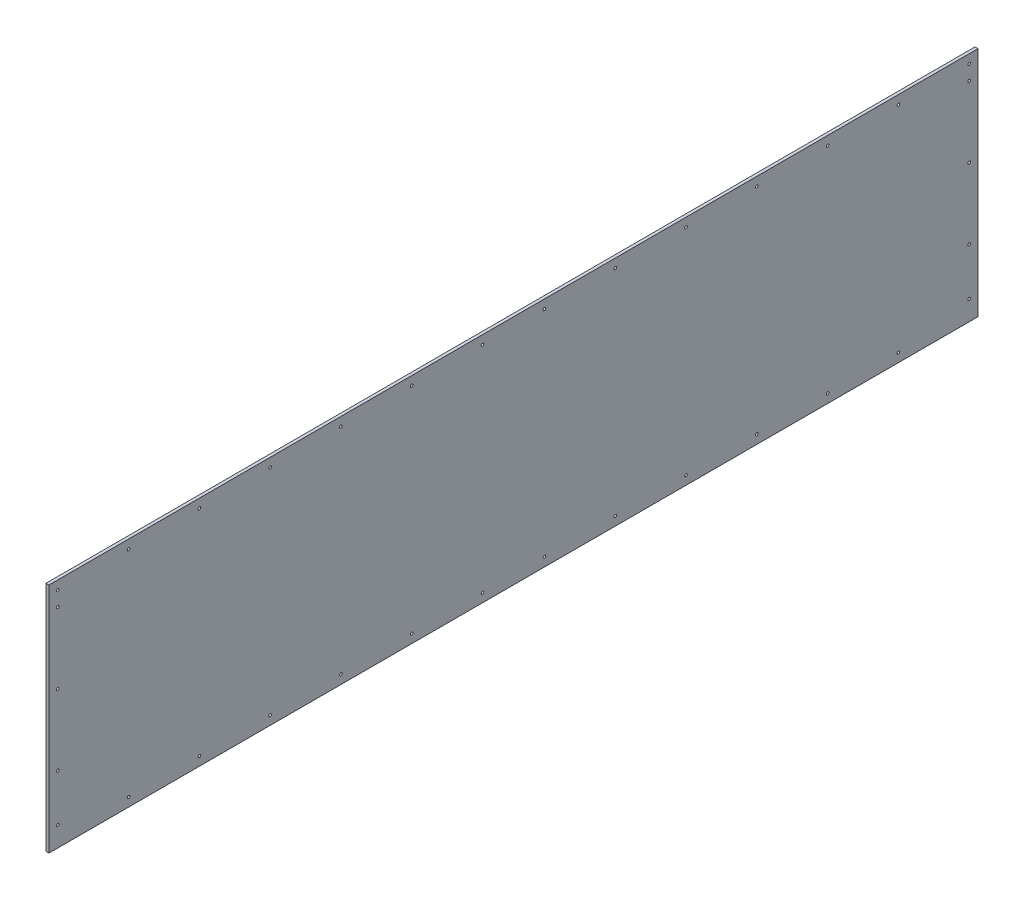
ISO-10303-21;
HEADER;
FILE_DESCRIPTION(('STEP AP214'),'2;1');
FILE_NAME('part.step','',(''),(''),'','','');
FILE_SCHEMA(('AUTOMOTIVE_DESIGN { 1 0 10303 214 1 1 1 1 }'));
ENDSEC;
DATA;
#1=APPLICATION_CONTEXT('core data for automotive mechanical design processes');
#2=APPLICATION_PROTOCOL_DEFINITION('international standard','automotive_design',2000,#1);
#3=PRODUCT_CONTEXT('',#1,'mechanical');
#4=PRODUCT('Part','Part','',(#3));
#5=PRODUCT_RELATED_PRODUCT_CATEGORY('part','',(#4));
#6=PRODUCT_DEFINITION_FORMATION('','',#4);
#7=PRODUCT_DEFINITION_CONTEXT('part definition',#1,'design');
#8=PRODUCT_DEFINITION('design','',#6,#7);
#9=PRODUCT_DEFINITION_SHAPE('','',#8);
#10=(LENGTH_UNIT() NAMED_UNIT(*) SI_UNIT(.MILLI.,.METRE.));
#11=(NAMED_UNIT(*) PLANE_ANGLE_UNIT() SI_UNIT($,.RADIAN.));
#12=(NAMED_UNIT(*) SI_UNIT($,.STERADIAN.) SOLID_ANGLE_UNIT());
#13=UNCERTAINTY_MEASURE_WITH_UNIT(LENGTH_MEASURE(1.E-05),#10,'distance_accuracy_value','');
#14=(GEOMETRIC_REPRESENTATION_CONTEXT(3) GLOBAL_UNCERTAINTY_ASSIGNED_CONTEXT((#13)) GLOBAL_UNIT_ASSIGNED_CONTEXT((#10,
#11,#12)) REPRESENTATION_CONTEXT('',''));
#15=CARTESIAN_POINT('',(0.,0.,0.));
#16=DIRECTION('',(0.,0.,1.));
#17=DIRECTION('',(1.,0.,0.));
#18=AXIS2_PLACEMENT_3D('',#15,#16,#17);
#19=CARTESIAN_POINT('',(6.35,0.,0.));
#20=DIRECTION('',(0.,0.,-1.));
#21=DIRECTION('',(-1.,0.,0.));
#22=AXIS2_PLACEMENT_3D('',#19,#20,#21);
#23=PLANE('',#22);
#24=DIRECTION('',(0.,-1.,0.));
#25=VECTOR('',#24,1.);
#26=CARTESIAN_POINT('',(0.,0.,0.));
#27=LINE('',#26,#25);
#28=CARTESIAN_POINT('',(0.,550.799,0.));
#29=VERTEX_POINT('',#28);
#30=CARTESIAN_POINT('',(0.,50.8,0.));
#31=VERTEX_POINT('',#30);
#32=EDGE_CURVE('E81',#29,#31,#27,.T.);
#33=ORIENTED_EDGE('',*,*,#32,.T.);
#34=DIRECTION('',(-1.,0.,0.));
#35=VECTOR('',#34,1.);
#36=CARTESIAN_POINT('',(6.35,50.8,0.));
#37=LINE('',#36,#35);
#38=CARTESIAN_POINT('',(6.35,50.8,0.));
#39=VERTEX_POINT('',#38);
#40=EDGE_CURVE('E47',#39,#31,#37,.T.);
#41=ORIENTED_EDGE('',*,*,#40,.F.);
#42=DIRECTION('',(0.,-1.,0.));
#43=VECTOR('',#42,1.);
#44=CARTESIAN_POINT('',(6.35,0.,0.));
#45=LINE('',#44,#43);
#46=CARTESIAN_POINT('',(6.35,550.799,0.));
#47=VERTEX_POINT('',#46);
#48=EDGE_CURVE('E76',#47,#39,#45,.T.);
#49=ORIENTED_EDGE('',*,*,#48,.F.);
#50=DIRECTION('',(-1.,0.,0.));
#51=VECTOR('',#50,1.);
#52=CARTESIAN_POINT('',(6.35,550.799,0.));
#53=LINE('',#52,#51);
#54=EDGE_CURVE('E40',#47,#29,#53,.T.);
#55=ORIENTED_EDGE('',*,*,#54,.T.);
#56=EDGE_LOOP('',(#33,#41,#49,#55));
#57=FACE_BOUND('',#56,.T.);
#58=ADVANCED_FACE('F33',(#57),#23,.F.);
#59=CARTESIAN_POINT('',(6.35,0.,-2000.25));
#60=DIRECTION('',(0.,0.,1.));
#61=DIRECTION('',(1.,0.,0.));
#62=AXIS2_PLACEMENT_3D('',#59,#60,#61);
#63=PLANE('',#62);
#64=DIRECTION('',(0.,1.,0.));
#65=VECTOR('',#64,1.);
#66=CARTESIAN_POINT('',(6.35,0.,-2000.25));
#67=LINE('',#66,#65);
#68=CARTESIAN_POINT('',(6.35,50.8,-2000.25));
#69=VERTEX_POINT('',#68);
#70=CARTESIAN_POINT('',(6.35,550.799,-2000.25));
#71=VERTEX_POINT('',#70);
#72=EDGE_CURVE('E93',#69,#71,#67,.T.);
#73=ORIENTED_EDGE('',*,*,#72,.F.);
#74=DIRECTION('',(-1.,0.,0.));
#75=VECTOR('',#74,1.);
#76=CARTESIAN_POINT('',(6.35,50.8,-2000.25));
#77=LINE('',#76,#75);
#78=CARTESIAN_POINT('',(0.,50.8,-2000.25));
#79=VERTEX_POINT('',#78);
#80=EDGE_CURVE('E294',#69,#79,#77,.T.);
#81=ORIENTED_EDGE('',*,*,#80,.T.);
#82=DIRECTION('',(0.,1.,0.));
#83=VECTOR('',#82,1.);
#84=CARTESIAN_POINT('',(0.,0.,-2000.25));
#85=LINE('',#84,#83);
#86=CARTESIAN_POINT('',(0.,550.799,-2000.25));
#87=VERTEX_POINT('',#86);
#88=EDGE_CURVE('E77',#79,#87,#85,.T.);
#89=ORIENTED_EDGE('',*,*,#88,.T.);
#90=DIRECTION('',(-1.,0.,0.));
#91=VECTOR('',#90,1.);
#92=CARTESIAN_POINT('',(6.35,550.799,-2000.25));
#93=LINE('',#92,#91);
#94=EDGE_CURVE('E11',#71,#87,#93,.T.);
#95=ORIENTED_EDGE('',*,*,#94,.F.);
#96=EDGE_LOOP('',(#73,#81,#89,#95));
#97=FACE_BOUND('',#96,.T.);
#98=ADVANCED_FACE('F309',(#97),#63,.F.);
#99=CARTESIAN_POINT('',(6.35,550.799,0.));
#100=DIRECTION('',(0.,-1.,0.));
#101=DIRECTION('',(0.,0.,-1.));
#102=AXIS2_PLACEMENT_3D('',#99,#100,#101);
#103=PLANE('',#102);
#104=DIRECTION('',(0.,0.,1.));
#105=VECTOR('',#104,1.);
#106=CARTESIAN_POINT('',(0.,550.799,0.));
#107=LINE('',#106,#105);
#108=EDGE_CURVE('E68',#87,#29,#107,.T.);
#109=ORIENTED_EDGE('',*,*,#108,.T.);
#110=ORIENTED_EDGE('',*,*,#54,.F.);
#111=DIRECTION('',(0.,0.,1.));
#112=VECTOR('',#111,1.);
#113=CARTESIAN_POINT('',(6.35,550.799,0.));
#114=LINE('',#113,#112);
#115=EDGE_CURVE('E56',#71,#47,#114,.T.);
#116=ORIENTED_EDGE('',*,*,#115,.F.);
#117=ORIENTED_EDGE('',*,*,#94,.T.);
#118=EDGE_LOOP('',(#109,#110,#116,#117));
#119=FACE_BOUND('',#118,.T.);
#120=ADVANCED_FACE('F70',(#119),#103,.F.);
#121=CARTESIAN_POINT('',(6.35,550.799,0.));
#122=DIRECTION('',(-1.,0.,0.));
#123=DIRECTION('',(0.,0.,1.));
#124=AXIS2_PLACEMENT_3D('',#121,#122,#123);
#125=PLANE('',#124);
#126=CARTESIAN_POINT('',(6.35,69.8499999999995,-1828.8));
#127=DIRECTION('',(1.,0.,0.));
#128=DIRECTION('',(0.,0.,1.));
#129=AXIS2_PLACEMENT_3D('',#126,#127,#128);
#130=CIRCLE('',#129,2.80669999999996);
#131=CARTESIAN_POINT('',(6.35,69.8499999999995,-1825.9933));
#132=VERTEX_POINT('',#131);
#133=EDGE_CURVE('E291',#132,#132,#130,.T.);
#134=ORIENTED_EDGE('',*,*,#133,.F.);
#135=EDGE_LOOP('',(#134));
#136=FACE_BOUND('',#135,.T.);
#137=CARTESIAN_POINT('',(6.35,69.8499999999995,-1676.4));
#138=DIRECTION('',(1.,0.,0.));
#139=DIRECTION('',(0.,0.,1.));
#140=AXIS2_PLACEMENT_3D('',#137,#138,#139);
#141=CIRCLE('',#140,2.80669999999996);
#142=CARTESIAN_POINT('',(6.35,69.8499999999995,-1673.5933));
#143=VERTEX_POINT('',#142);
#144=EDGE_CURVE('E285',#143,#143,#141,.T.);
#145=ORIENTED_EDGE('',*,*,#144,.F.);
#146=EDGE_LOOP('',(#145));
#147=FACE_BOUND('',#146,.T.);
#148=CARTESIAN_POINT('',(6.35,69.8499999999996,-1524.));
#149=DIRECTION('',(1.,0.,0.));
#150=DIRECTION('',(0.,0.,1.));
#151=AXIS2_PLACEMENT_3D('',#148,#149,#150);
#152=CIRCLE('',#151,2.80669999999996);
#153=CARTESIAN_POINT('',(6.35,69.8499999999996,-1521.1933));
#154=VERTEX_POINT('',#153);
#155=EDGE_CURVE('E279',#154,#154,#152,.T.);
#156=ORIENTED_EDGE('',*,*,#155,.F.);
#157=EDGE_LOOP('',(#156));
#158=FACE_BOUND('',#157,.T.);
#159=CARTESIAN_POINT('',(6.35,69.8499999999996,-1371.6));
#160=DIRECTION('',(1.,0.,0.));
#161=DIRECTION('',(0.,0.,1.));
#162=AXIS2_PLACEMENT_3D('',#159,#160,#161);
#163=CIRCLE('',#162,2.80669999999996);
#164=CARTESIAN_POINT('',(6.35,69.8499999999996,-1368.7933));
#165=VERTEX_POINT('',#164);
#166=EDGE_CURVE('E273',#165,#165,#163,.T.);
#167=ORIENTED_EDGE('',*,*,#166,.F.);
#168=EDGE_LOOP('',(#167));
#169=FACE_BOUND('',#168,.T.);
#170=CARTESIAN_POINT('',(6.35,69.8499999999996,-1219.2));
#171=DIRECTION('',(1.,0.,0.));
#172=DIRECTION('',(0.,0.,1.));
#173=AXIS2_PLACEMENT_3D('',#170,#171,#172);
#174=CIRCLE('',#173,2.80669999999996);
#175=CARTESIAN_POINT('',(6.35,69.8499999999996,-1216.3933));
#176=VERTEX_POINT('',#175);
#177=EDGE_CURVE('E267',#176,#176,#174,.T.);
#178=ORIENTED_EDGE('',*,*,#177,.F.);
#179=EDGE_LOOP('',(#178));
#180=FACE_BOUND('',#179,.T.);
#181=CARTESIAN_POINT('',(6.35,69.8499999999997,-1066.8));
#182=DIRECTION('',(1.,0.,0.));
#183=DIRECTION('',(0.,0.,1.));
#184=AXIS2_PLACEMENT_3D('',#181,#182,#183);
#185=CIRCLE('',#184,2.80669999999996);
#186=CARTESIAN_POINT('',(6.35,69.8499999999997,-1063.9933));
#187=VERTEX_POINT('',#186);
#188=EDGE_CURVE('E261',#187,#187,#185,.T.);
#189=ORIENTED_EDGE('',*,*,#188,.F.);
#190=EDGE_LOOP('',(#189));
#191=FACE_BOUND('',#190,.T.);
#192=CARTESIAN_POINT('',(6.35,347.599,-1981.2));
#193=DIRECTION('',(1.,0.,0.));
#194=DIRECTION('',(0.,0.,-1.));
#195=AXIS2_PLACEMENT_3D('',#192,#193,#194);
#196=CIRCLE('',#195,2.80669999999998);
#197=CARTESIAN_POINT('',(6.35,347.599,-1984.0067));
#198=VERTEX_POINT('',#197);
#199=EDGE_CURVE('E255',#198,#198,#196,.T.);
#200=ORIENTED_EDGE('',*,*,#199,.F.);
#201=EDGE_LOOP('',(#200));
#202=FACE_BOUND('',#201,.T.);
#203=CARTESIAN_POINT('',(6.35,499.999,-1981.2));
#204=DIRECTION('',(1.,0.,0.));
#205=DIRECTION('',(0.,0.,-1.));
#206=AXIS2_PLACEMENT_3D('',#203,#204,#205);
#207=CIRCLE('',#206,2.80669999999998);
#208=CARTESIAN_POINT('',(6.35,499.999,-1984.0067));
#209=VERTEX_POINT('',#208);
#210=EDGE_CURVE('E249',#209,#209,#207,.T.);
#211=ORIENTED_EDGE('',*,*,#210,.F.);
#212=EDGE_LOOP('',(#211));
#213=FACE_BOUND('',#212,.T.);
#214=CARTESIAN_POINT('',(6.35,531.749,-1981.2));
#215=DIRECTION('',(1.,0.,0.));
#216=DIRECTION('',(0.,0.,-1.));
#217=AXIS2_PLACEMENT_3D('',#214,#215,#216);
#218=CIRCLE('',#217,2.80669999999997);
#219=CARTESIAN_POINT('',(6.35,531.749,-1984.0067));
#220=VERTEX_POINT('',#219);
#221=EDGE_CURVE('E243',#220,#220,#218,.T.);
#222=ORIENTED_EDGE('',*,*,#221,.F.);
#223=EDGE_LOOP('',(#222));
#224=FACE_BOUND('',#223,.T.);
#225=CARTESIAN_POINT('',(6.35,531.749,-1828.8));
#226=DIRECTION('',(1.,0.,0.));
#227=DIRECTION('',(0.,0.,-1.));
#228=AXIS2_PLACEMENT_3D('',#225,#226,#227);
#229=CIRCLE('',#228,2.80669999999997);
#230=CARTESIAN_POINT('',(6.35,531.749,-1831.6067));
#231=VERTEX_POINT('',#230);
#232=EDGE_CURVE('E237',#231,#231,#229,.T.);
#233=ORIENTED_EDGE('',*,*,#232,.F.);
#234=EDGE_LOOP('',(#233));
#235=FACE_BOUND('',#234,.T.);
#236=CARTESIAN_POINT('',(6.35,531.749,-1676.4));
#237=DIRECTION('',(1.,0.,0.));
#238=DIRECTION('',(0.,0.,-1.));
#239=AXIS2_PLACEMENT_3D('',#236,#237,#238);
#240=CIRCLE('',#239,2.80669999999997);
#241=CARTESIAN_POINT('',(6.35,531.749,-1679.2067));
#242=VERTEX_POINT('',#241);
#243=EDGE_CURVE('E231',#242,#242,#240,.T.);
#244=ORIENTED_EDGE('',*,*,#243,.F.);
#245=EDGE_LOOP('',(#244));
#246=FACE_BOUND('',#245,.T.);
#247=CARTESIAN_POINT('',(6.35,531.749,-1524.));
#248=DIRECTION('',(1.,0.,0.));
#249=DIRECTION('',(0.,0.,-1.));
#250=AXIS2_PLACEMENT_3D('',#247,#248,#249);
#251=CIRCLE('',#250,2.80669999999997);
#252=CARTESIAN_POINT('',(6.35,531.749,-1526.8067));
#253=VERTEX_POINT('',#252);
#254=EDGE_CURVE('E225',#253,#253,#251,.T.);
#255=ORIENTED_EDGE('',*,*,#254,.F.);
#256=EDGE_LOOP('',(#255));
#257=FACE_BOUND('',#256,.T.);
#258=CARTESIAN_POINT('',(6.35,531.749,-1371.6));
#259=DIRECTION('',(1.,0.,0.));
#260=DIRECTION('',(0.,0.,-1.));
#261=AXIS2_PLACEMENT_3D('',#258,#259,#260);
#262=CIRCLE('',#261,2.80669999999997);
#263=CARTESIAN_POINT('',(6.35,531.749,-1374.4067));
#264=VERTEX_POINT('',#263);
#265=EDGE_CURVE('E219',#264,#264,#262,.T.);
#266=ORIENTED_EDGE('',*,*,#265,.F.);
#267=EDGE_LOOP('',(#266));
#268=FACE_BOUND('',#267,.T.);
#269=CARTESIAN_POINT('',(6.35,531.749,-1219.2));
#270=DIRECTION('',(1.,0.,0.));
#271=DIRECTION('',(0.,0.,-1.));
#272=AXIS2_PLACEMENT_3D('',#269,#270,#271);
#273=CIRCLE('',#272,2.80669999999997);
#274=CARTESIAN_POINT('',(6.35,531.749,-1222.0067));
#275=VERTEX_POINT('',#274);
#276=EDGE_CURVE('E213',#275,#275,#273,.T.);
#277=ORIENTED_EDGE('',*,*,#276,.F.);
#278=EDGE_LOOP('',(#277));
#279=FACE_BOUND('',#278,.T.);
#280=CARTESIAN_POINT('',(6.35,531.749,-1066.8));
#281=DIRECTION('',(1.,0.,0.));
#282=DIRECTION('',(0.,0.,-1.));
#283=AXIS2_PLACEMENT_3D('',#280,#281,#282);
#284=CIRCLE('',#283,2.80669999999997);
#285=CARTESIAN_POINT('',(6.35,531.749,-1069.6067));
#286=VERTEX_POINT('',#285);
#287=EDGE_CURVE('E207',#286,#286,#284,.T.);
#288=ORIENTED_EDGE('',*,*,#287,.F.);
#289=EDGE_LOOP('',(#288));
#290=FACE_BOUND('',#289,.T.);
#291=CARTESIAN_POINT('',(6.35,531.749,-933.45));
#292=DIRECTION('',(1.,0.,0.));
#293=DIRECTION('',(0.,0.,-1.));
#294=AXIS2_PLACEMENT_3D('',#291,#292,#293);
#295=CIRCLE('',#294,2.80669999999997);
#296=CARTESIAN_POINT('',(6.35,531.749,-936.2567));
#297=VERTEX_POINT('',#296);
#298=EDGE_CURVE('E201',#297,#297,#295,.T.);
#299=ORIENTED_EDGE('',*,*,#298,.F.);
#300=EDGE_LOOP('',(#299));
#301=FACE_BOUND('',#300,.T.);
#302=CARTESIAN_POINT('',(6.35,531.749,-781.05));
#303=DIRECTION('',(1.,0.,0.));
#304=DIRECTION('',(0.,0.,-1.));
#305=AXIS2_PLACEMENT_3D('',#302,#303,#304);
#306=CIRCLE('',#305,2.80669999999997);
#307=CARTESIAN_POINT('',(6.35,531.749,-783.8567));
#308=VERTEX_POINT('',#307);
#309=EDGE_CURVE('E195',#308,#308,#306,.T.);
#310=ORIENTED_EDGE('',*,*,#309,.F.);
#311=EDGE_LOOP('',(#310));
#312=FACE_BOUND('',#311,.T.);
#313=CARTESIAN_POINT('',(6.35,531.749,-628.65));
#314=DIRECTION('',(1.,0.,0.));
#315=DIRECTION('',(0.,0.,-1.));
#316=AXIS2_PLACEMENT_3D('',#313,#314,#315);
#317=CIRCLE('',#316,2.80669999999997);
#318=CARTESIAN_POINT('',(6.35,531.749,-631.4567));
#319=VERTEX_POINT('',#318);
#320=EDGE_CURVE('E189',#319,#319,#317,.T.);
#321=ORIENTED_EDGE('',*,*,#320,.F.);
#322=EDGE_LOOP('',(#321));
#323=FACE_BOUND('',#322,.T.);
#324=CARTESIAN_POINT('',(6.35,531.749,-476.25));
#325=DIRECTION('',(1.,0.,0.));
#326=DIRECTION('',(0.,0.,-1.));
#327=AXIS2_PLACEMENT_3D('',#324,#325,#326);
#328=CIRCLE('',#327,2.80670000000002);
#329=CARTESIAN_POINT('',(6.35,531.749,-479.0567));
#330=VERTEX_POINT('',#329);
#331=EDGE_CURVE('E183',#330,#330,#328,.T.);
#332=ORIENTED_EDGE('',*,*,#331,.F.);
#333=EDGE_LOOP('',(#332));
#334=FACE_BOUND('',#333,.T.);
#335=CARTESIAN_POINT('',(6.35,531.749,-323.85));
#336=DIRECTION('',(1.,0.,0.));
#337=DIRECTION('',(0.,0.,-1.));
#338=AXIS2_PLACEMENT_3D('',#335,#336,#337);
#339=CIRCLE('',#338,2.80670000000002);
#340=CARTESIAN_POINT('',(6.35,531.749,-326.6567));
#341=VERTEX_POINT('',#340);
#342=EDGE_CURVE('E177',#341,#341,#339,.T.);
#343=ORIENTED_EDGE('',*,*,#342,.F.);
#344=EDGE_LOOP('',(#343));
#345=FACE_BOUND('',#344,.T.);
#346=CARTESIAN_POINT('',(6.35,531.749,-171.45));
#347=DIRECTION('',(1.,0.,0.));
#348=DIRECTION('',(0.,0.,-1.));
#349=AXIS2_PLACEMENT_3D('',#346,#347,#348);
#350=CIRCLE('',#349,2.80670000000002);
#351=CARTESIAN_POINT('',(6.35,531.749,-174.2567));
#352=VERTEX_POINT('',#351);
#353=EDGE_CURVE('E171',#352,#352,#350,.T.);
#354=ORIENTED_EDGE('',*,*,#353,.F.);
#355=EDGE_LOOP('',(#354));
#356=FACE_BOUND('',#355,.T.);
#357=CARTESIAN_POINT('',(6.35,499.999,-19.05));
#358=DIRECTION('',(1.,0.,0.));
#359=DIRECTION('',(0.,0.,-1.));
#360=AXIS2_PLACEMENT_3D('',#357,#358,#359);
#361=CIRCLE('',#360,2.80670000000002);
#362=CARTESIAN_POINT('',(6.35,499.999,-21.8567));
#363=VERTEX_POINT('',#362);
#364=EDGE_CURVE('E165',#363,#363,#361,.T.);
#365=ORIENTED_EDGE('',*,*,#364,.F.);
#366=EDGE_LOOP('',(#365));
#367=FACE_BOUND('',#366,.T.);
#368=CARTESIAN_POINT('',(6.35,69.8499999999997,-933.45));
#369=DIRECTION('',(1.,0.,0.));
#370=DIRECTION('',(0.,0.,1.));
#371=AXIS2_PLACEMENT_3D('',#368,#369,#370);
#372=CIRCLE('',#371,2.80669999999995);
#373=CARTESIAN_POINT('',(6.35,69.8499999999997,-930.6433));
#374=VERTEX_POINT('',#373);
#375=EDGE_CURVE('E159',#374,#374,#372,.T.);
#376=ORIENTED_EDGE('',*,*,#375,.F.);
#377=EDGE_LOOP('',(#376));
#378=FACE_BOUND('',#377,.T.);
#379=CARTESIAN_POINT('',(6.35,93.5989999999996,-1981.2));
#380=DIRECTION('',(1.,0.,0.));
#381=DIRECTION('',(0.,0.,-1.));
#382=AXIS2_PLACEMENT_3D('',#379,#380,#381);
#383=CIRCLE('',#382,2.80669999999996);
#384=CARTESIAN_POINT('',(6.35,93.5989999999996,-1984.0067));
#385=VERTEX_POINT('',#384);
#386=EDGE_CURVE('E153',#385,#385,#383,.T.);
#387=ORIENTED_EDGE('',*,*,#386,.F.);
#388=EDGE_LOOP('',(#387));
#389=FACE_BOUND('',#388,.T.);
#390=CARTESIAN_POINT('',(6.35,195.199,-1981.2));
#391=DIRECTION('',(1.,0.,0.));
#392=DIRECTION('',(0.,0.,-1.));
#393=AXIS2_PLACEMENT_3D('',#390,#391,#392);
#394=CIRCLE('',#393,2.80669999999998);
#395=CARTESIAN_POINT('',(6.35,195.199,-1984.0067));
#396=VERTEX_POINT('',#395);
#397=EDGE_CURVE('E147',#396,#396,#394,.T.);
#398=ORIENTED_EDGE('',*,*,#397,.F.);
#399=EDGE_LOOP('',(#398));
#400=FACE_BOUND('',#399,.T.);
#401=CARTESIAN_POINT('',(6.35,69.8499999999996,-781.05));
#402=DIRECTION('',(1.,0.,0.));
#403=DIRECTION('',(0.,0.,1.));
#404=AXIS2_PLACEMENT_3D('',#401,#402,#403);
#405=CIRCLE('',#404,2.80669999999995);
#406=CARTESIAN_POINT('',(6.35,69.8499999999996,-778.2433));
#407=VERTEX_POINT('',#406);
#408=EDGE_CURVE('E141',#407,#407,#405,.T.);
#409=ORIENTED_EDGE('',*,*,#408,.F.);
#410=EDGE_LOOP('',(#409));
#411=FACE_BOUND('',#410,.T.);
#412=CARTESIAN_POINT('',(6.35,69.8499999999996,-628.65));
#413=DIRECTION('',(1.,0.,0.));
#414=DIRECTION('',(0.,0.,1.));
#415=AXIS2_PLACEMENT_3D('',#412,#413,#414);
#416=CIRCLE('',#415,2.80669999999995);
#417=CARTESIAN_POINT('',(6.35,69.8499999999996,-625.8433));
#418=VERTEX_POINT('',#417);
#419=EDGE_CURVE('E135',#418,#418,#416,.T.);
#420=ORIENTED_EDGE('',*,*,#419,.F.);
#421=EDGE_LOOP('',(#420));
#422=FACE_BOUND('',#421,.T.);
#423=CARTESIAN_POINT('',(6.35,69.8499999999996,-476.25));
#424=DIRECTION('',(1.,0.,0.));
#425=DIRECTION('',(0.,0.,1.));
#426=AXIS2_PLACEMENT_3D('',#423,#424,#425);
#427=CIRCLE('',#426,2.80670000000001);
#428=CARTESIAN_POINT('',(6.35,69.8499999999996,-473.4433));
#429=VERTEX_POINT('',#428);
#430=EDGE_CURVE('E129',#429,#429,#427,.T.);
#431=ORIENTED_EDGE('',*,*,#430,.F.);
#432=EDGE_LOOP('',(#431));
#433=FACE_BOUND('',#432,.T.);
#434=CARTESIAN_POINT('',(6.35,69.8499999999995,-323.85));
#435=DIRECTION('',(1.,0.,0.));
#436=DIRECTION('',(0.,0.,1.));
#437=AXIS2_PLACEMENT_3D('',#434,#435,#436);
#438=CIRCLE('',#437,2.80670000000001);
#439=CARTESIAN_POINT('',(6.35,69.8499999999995,-321.0433));
#440=VERTEX_POINT('',#439);
#441=EDGE_CURVE('E123',#440,#440,#438,.T.);
#442=ORIENTED_EDGE('',*,*,#441,.F.);
#443=EDGE_LOOP('',(#442));
#444=FACE_BOUND('',#443,.T.);
#445=CARTESIAN_POINT('',(6.35,69.8499999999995,-171.45));
#446=DIRECTION('',(1.,0.,0.));
#447=DIRECTION('',(0.,0.,1.));
#448=AXIS2_PLACEMENT_3D('',#445,#446,#447);
#449=CIRCLE('',#448,2.80670000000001);
#450=CARTESIAN_POINT('',(6.35,69.8499999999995,-168.6433));
#451=VERTEX_POINT('',#450);
#452=EDGE_CURVE('E117',#451,#451,#449,.T.);
#453=ORIENTED_EDGE('',*,*,#452,.F.);
#454=EDGE_LOOP('',(#453));
#455=FACE_BOUND('',#454,.T.);
#456=CARTESIAN_POINT('',(6.35,195.199,-19.0500000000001));
#457=DIRECTION('',(1.,0.,0.));
#458=DIRECTION('',(0.,0.,-1.));
#459=AXIS2_PLACEMENT_3D('',#456,#457,#458);
#460=CIRCLE('',#459,2.80670000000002);
#461=CARTESIAN_POINT('',(6.35,195.199,-21.8567000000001));
#462=VERTEX_POINT('',#461);
#463=EDGE_CURVE('E111',#462,#462,#460,.T.);
#464=ORIENTED_EDGE('',*,*,#463,.F.);
#465=EDGE_LOOP('',(#464));
#466=FACE_BOUND('',#465,.T.);
#467=CARTESIAN_POINT('',(6.35,347.599,-19.05));
#468=DIRECTION('',(1.,0.,0.));
#469=DIRECTION('',(0.,0.,-1.));
#470=AXIS2_PLACEMENT_3D('',#467,#468,#469);
#471=CIRCLE('',#470,2.80670000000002);
#472=CARTESIAN_POINT('',(6.35,347.599,-21.8567000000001));
#473=VERTEX_POINT('',#472);
#474=EDGE_CURVE('E105',#473,#473,#471,.T.);
#475=ORIENTED_EDGE('',*,*,#474,.F.);
#476=EDGE_LOOP('',(#475));
#477=FACE_BOUND('',#476,.T.);
#478=CARTESIAN_POINT('',(6.35,93.5989999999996,-19.0500000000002));
#479=DIRECTION('',(1.,0.,0.));
#480=DIRECTION('',(0.,0.,-1.));
#481=AXIS2_PLACEMENT_3D('',#478,#479,#480);
#482=CIRCLE('',#481,2.80670000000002);
#483=CARTESIAN_POINT('',(6.35,93.5989999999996,-21.8567000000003));
#484=VERTEX_POINT('',#483);
#485=EDGE_CURVE('E99',#484,#484,#482,.T.);
#486=ORIENTED_EDGE('',*,*,#485,.F.);
#487=EDGE_LOOP('',(#486));
#488=FACE_BOUND('',#487,.T.);
#489=CARTESIAN_POINT('',(6.35,531.749,-19.05));
#490=DIRECTION('',(1.,0.,0.));
#491=DIRECTION('',(0.,0.,-1.));
#492=AXIS2_PLACEMENT_3D('',#489,#490,#491);
#493=CIRCLE('',#492,2.80670000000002);
#494=CARTESIAN_POINT('',(6.35,531.749,-21.8567));
#495=VERTEX_POINT('',#494);
#496=EDGE_CURVE('E89',#495,#495,#493,.T.);
#497=ORIENTED_EDGE('',*,*,#496,.F.);
#498=EDGE_LOOP('',(#497));
#499=FACE_BOUND('',#498,.T.);
#500=ORIENTED_EDGE('',*,*,#48,.T.);
#501=DIRECTION('',(0.,0.,-1.));
#502=VECTOR('',#501,1.);
#503=CARTESIAN_POINT('',(6.35,50.8,-2000.25));
#504=LINE('',#503,#502);
#505=EDGE_CURVE('E298',#39,#69,#504,.T.);
#506=ORIENTED_EDGE('',*,*,#505,.T.);
#507=ORIENTED_EDGE('',*,*,#72,.T.);
#508=ORIENTED_EDGE('',*,*,#115,.T.);
#509=EDGE_LOOP('',(#500,#506,#507,#508));
#510=FACE_BOUND('',#509,.T.);
#511=ADVANCED_FACE('F304',(#136,#147,#158,#169,#180,#191,#202,#213,#224,#235,#246,#257,#268,
#279,#290,#301,#312,#323,#334,#345,#356,#367,#378,#389,#400,#411,#422,#433,#444,#455,#466,#477,
#488,#499,#510),#125,.F.);
#512=CARTESIAN_POINT('',(0.,550.799,0.));
#513=DIRECTION('',(-1.,0.,0.));
#514=DIRECTION('',(0.,0.,1.));
#515=AXIS2_PLACEMENT_3D('',#512,#513,#514);
#516=PLANE('',#515);
#517=DIRECTION('',(0.,0.,-1.));
#518=VECTOR('',#517,1.);
#519=CARTESIAN_POINT('',(0.,50.8,-2000.25));
#520=LINE('',#519,#518);
#521=EDGE_CURVE('E84',#31,#79,#520,.T.);
#522=ORIENTED_EDGE('',*,*,#521,.F.);
#523=ORIENTED_EDGE('',*,*,#32,.F.);
#524=ORIENTED_EDGE('',*,*,#108,.F.);
#525=ORIENTED_EDGE('',*,*,#88,.F.);
#526=EDGE_LOOP('',(#522,#523,#524,#525));
#527=FACE_BOUND('',#526,.T.);
#528=CARTESIAN_POINT('',(0.,69.8499999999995,-1828.8));
#529=DIRECTION('',(1.,0.,0.));
#530=DIRECTION('',(0.,0.,1.));
#531=AXIS2_PLACEMENT_3D('',#528,#529,#530);
#532=CIRCLE('',#531,2.80669999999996);
#533=CARTESIAN_POINT('',(0.,69.8499999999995,-1825.9933));
#534=VERTEX_POINT('',#533);
#535=EDGE_CURVE('E288',#534,#534,#532,.T.);
#536=ORIENTED_EDGE('',*,*,#535,.T.);
#537=EDGE_LOOP('',(#536));
#538=FACE_BOUND('',#537,.T.);
#539=CARTESIAN_POINT('',(0.,69.8499999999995,-1676.4));
#540=DIRECTION('',(1.,0.,0.));
#541=DIRECTION('',(0.,0.,1.));
#542=AXIS2_PLACEMENT_3D('',#539,#540,#541);
#543=CIRCLE('',#542,2.80669999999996);
#544=CARTESIAN_POINT('',(0.,69.8499999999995,-1673.5933));
#545=VERTEX_POINT('',#544);
#546=EDGE_CURVE('E282',#545,#545,#543,.T.);
#547=ORIENTED_EDGE('',*,*,#546,.T.);
#548=EDGE_LOOP('',(#547));
#549=FACE_BOUND('',#548,.T.);
#550=CARTESIAN_POINT('',(0.,69.8499999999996,-1524.));
#551=DIRECTION('',(1.,0.,0.));
#552=DIRECTION('',(0.,0.,1.));
#553=AXIS2_PLACEMENT_3D('',#550,#551,#552);
#554=CIRCLE('',#553,2.80669999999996);
#555=CARTESIAN_POINT('',(0.,69.8499999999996,-1521.1933));
#556=VERTEX_POINT('',#555);
#557=EDGE_CURVE('E276',#556,#556,#554,.T.);
#558=ORIENTED_EDGE('',*,*,#557,.T.);
#559=EDGE_LOOP('',(#558));
#560=FACE_BOUND('',#559,.T.);
#561=CARTESIAN_POINT('',(0.,69.8499999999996,-1371.6));
#562=DIRECTION('',(1.,0.,0.));
#563=DIRECTION('',(0.,0.,1.));
#564=AXIS2_PLACEMENT_3D('',#561,#562,#563);
#565=CIRCLE('',#564,2.80669999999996);
#566=CARTESIAN_POINT('',(0.,69.8499999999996,-1368.7933));
#567=VERTEX_POINT('',#566);
#568=EDGE_CURVE('E270',#567,#567,#565,.T.);
#569=ORIENTED_EDGE('',*,*,#568,.T.);
#570=EDGE_LOOP('',(#569));
#571=FACE_BOUND('',#570,.T.);
#572=CARTESIAN_POINT('',(0.,69.8499999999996,-1219.2));
#573=DIRECTION('',(1.,0.,0.));
#574=DIRECTION('',(0.,0.,1.));
#575=AXIS2_PLACEMENT_3D('',#572,#573,#574);
#576=CIRCLE('',#575,2.80669999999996);
#577=CARTESIAN_POINT('',(0.,69.8499999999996,-1216.3933));
#578=VERTEX_POINT('',#577);
#579=EDGE_CURVE('E264',#578,#578,#576,.T.);
#580=ORIENTED_EDGE('',*,*,#579,.T.);
#581=EDGE_LOOP('',(#580));
#582=FACE_BOUND('',#581,.T.);
#583=CARTESIAN_POINT('',(0.,69.8499999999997,-1066.8));
#584=DIRECTION('',(1.,0.,0.));
#585=DIRECTION('',(0.,0.,1.));
#586=AXIS2_PLACEMENT_3D('',#583,#584,#585);
#587=CIRCLE('',#586,2.80669999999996);
#588=CARTESIAN_POINT('',(0.,69.8499999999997,-1063.9933));
#589=VERTEX_POINT('',#588);
#590=EDGE_CURVE('E258',#589,#589,#587,.T.);
#591=ORIENTED_EDGE('',*,*,#590,.T.);
#592=EDGE_LOOP('',(#591));
#593=FACE_BOUND('',#592,.T.);
#594=CARTESIAN_POINT('',(0.,347.599,-1981.2));
#595=DIRECTION('',(1.,0.,0.));
#596=DIRECTION('',(0.,0.,-1.));
#597=AXIS2_PLACEMENT_3D('',#594,#595,#596);
#598=CIRCLE('',#597,2.80669999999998);
#599=CARTESIAN_POINT('',(0.,347.599,-1984.0067));
#600=VERTEX_POINT('',#599);
#601=EDGE_CURVE('E252',#600,#600,#598,.T.);
#602=ORIENTED_EDGE('',*,*,#601,.T.);
#603=EDGE_LOOP('',(#602));
#604=FACE_BOUND('',#603,.T.);
#605=CARTESIAN_POINT('',(0.,499.999,-1981.2));
#606=DIRECTION('',(1.,0.,0.));
#607=DIRECTION('',(0.,0.,-1.));
#608=AXIS2_PLACEMENT_3D('',#605,#606,#607);
#609=CIRCLE('',#608,2.80669999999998);
#610=CARTESIAN_POINT('',(0.,499.999,-1984.0067));
#611=VERTEX_POINT('',#610);
#612=EDGE_CURVE('E246',#611,#611,#609,.T.);
#613=ORIENTED_EDGE('',*,*,#612,.T.);
#614=EDGE_LOOP('',(#613));
#615=FACE_BOUND('',#614,.T.);
#616=CARTESIAN_POINT('',(0.,531.749,-1981.2));
#617=DIRECTION('',(1.,0.,0.));
#618=DIRECTION('',(0.,0.,-1.));
#619=AXIS2_PLACEMENT_3D('',#616,#617,#618);
#620=CIRCLE('',#619,2.80669999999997);
#621=CARTESIAN_POINT('',(0.,531.749,-1984.0067));
#622=VERTEX_POINT('',#621);
#623=EDGE_CURVE('E240',#622,#622,#620,.T.);
#624=ORIENTED_EDGE('',*,*,#623,.T.);
#625=EDGE_LOOP('',(#624));
#626=FACE_BOUND('',#625,.T.);
#627=CARTESIAN_POINT('',(0.,531.749,-1828.8));
#628=DIRECTION('',(1.,0.,0.));
#629=DIRECTION('',(0.,0.,-1.));
#630=AXIS2_PLACEMENT_3D('',#627,#628,#629);
#631=CIRCLE('',#630,2.80669999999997);
#632=CARTESIAN_POINT('',(0.,531.749,-1831.6067));
#633=VERTEX_POINT('',#632);
#634=EDGE_CURVE('E234',#633,#633,#631,.T.);
#635=ORIENTED_EDGE('',*,*,#634,.T.);
#636=EDGE_LOOP('',(#635));
#637=FACE_BOUND('',#636,.T.);
#638=CARTESIAN_POINT('',(0.,531.749,-1676.4));
#639=DIRECTION('',(1.,0.,0.));
#640=DIRECTION('',(0.,0.,-1.));
#641=AXIS2_PLACEMENT_3D('',#638,#639,#640);
#642=CIRCLE('',#641,2.80669999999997);
#643=CARTESIAN_POINT('',(0.,531.749,-1679.2067));
#644=VERTEX_POINT('',#643);
#645=EDGE_CURVE('E228',#644,#644,#642,.T.);
#646=ORIENTED_EDGE('',*,*,#645,.T.);
#647=EDGE_LOOP('',(#646));
#648=FACE_BOUND('',#647,.T.);
#649=CARTESIAN_POINT('',(0.,531.749,-1524.));
#650=DIRECTION('',(1.,0.,0.));
#651=DIRECTION('',(0.,0.,-1.));
#652=AXIS2_PLACEMENT_3D('',#649,#650,#651);
#653=CIRCLE('',#652,2.80669999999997);
#654=CARTESIAN_POINT('',(0.,531.749,-1526.8067));
#655=VERTEX_POINT('',#654);
#656=EDGE_CURVE('E222',#655,#655,#653,.T.);
#657=ORIENTED_EDGE('',*,*,#656,.T.);
#658=EDGE_LOOP('',(#657));
#659=FACE_BOUND('',#658,.T.);
#660=CARTESIAN_POINT('',(0.,531.749,-1371.6));
#661=DIRECTION('',(1.,0.,0.));
#662=DIRECTION('',(0.,0.,-1.));
#663=AXIS2_PLACEMENT_3D('',#660,#661,#662);
#664=CIRCLE('',#663,2.80669999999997);
#665=CARTESIAN_POINT('',(0.,531.749,-1374.4067));
#666=VERTEX_POINT('',#665);
#667=EDGE_CURVE('E216',#666,#666,#664,.T.);
#668=ORIENTED_EDGE('',*,*,#667,.T.);
#669=EDGE_LOOP('',(#668));
#670=FACE_BOUND('',#669,.T.);
#671=CARTESIAN_POINT('',(0.,531.749,-1219.2));
#672=DIRECTION('',(1.,0.,0.));
#673=DIRECTION('',(0.,0.,-1.));
#674=AXIS2_PLACEMENT_3D('',#671,#672,#673);
#675=CIRCLE('',#674,2.80669999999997);
#676=CARTESIAN_POINT('',(0.,531.749,-1222.0067));
#677=VERTEX_POINT('',#676);
#678=EDGE_CURVE('E210',#677,#677,#675,.T.);
#679=ORIENTED_EDGE('',*,*,#678,.T.);
#680=EDGE_LOOP('',(#679));
#681=FACE_BOUND('',#680,.T.);
#682=CARTESIAN_POINT('',(0.,531.749,-1066.8));
#683=DIRECTION('',(1.,0.,0.));
#684=DIRECTION('',(0.,0.,-1.));
#685=AXIS2_PLACEMENT_3D('',#682,#683,#684);
#686=CIRCLE('',#685,2.80669999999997);
#687=CARTESIAN_POINT('',(0.,531.749,-1069.6067));
#688=VERTEX_POINT('',#687);
#689=EDGE_CURVE('E204',#688,#688,#686,.T.);
#690=ORIENTED_EDGE('',*,*,#689,.T.);
#691=EDGE_LOOP('',(#690));
#692=FACE_BOUND('',#691,.T.);
#693=CARTESIAN_POINT('',(0.,531.749,-933.45));
#694=DIRECTION('',(1.,0.,0.));
#695=DIRECTION('',(0.,0.,-1.));
#696=AXIS2_PLACEMENT_3D('',#693,#694,#695);
#697=CIRCLE('',#696,2.80669999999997);
#698=CARTESIAN_POINT('',(0.,531.749,-936.2567));
#699=VERTEX_POINT('',#698);
#700=EDGE_CURVE('E198',#699,#699,#697,.T.);
#701=ORIENTED_EDGE('',*,*,#700,.T.);
#702=EDGE_LOOP('',(#701));
#703=FACE_BOUND('',#702,.T.);
#704=CARTESIAN_POINT('',(0.,531.749,-781.05));
#705=DIRECTION('',(1.,0.,0.));
#706=DIRECTION('',(0.,0.,-1.));
#707=AXIS2_PLACEMENT_3D('',#704,#705,#706);
#708=CIRCLE('',#707,2.80669999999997);
#709=CARTESIAN_POINT('',(0.,531.749,-783.8567));
#710=VERTEX_POINT('',#709);
#711=EDGE_CURVE('E192',#710,#710,#708,.T.);
#712=ORIENTED_EDGE('',*,*,#711,.T.);
#713=EDGE_LOOP('',(#712));
#714=FACE_BOUND('',#713,.T.);
#715=CARTESIAN_POINT('',(0.,531.749,-628.65));
#716=DIRECTION('',(1.,0.,0.));
#717=DIRECTION('',(0.,0.,-1.));
#718=AXIS2_PLACEMENT_3D('',#715,#716,#717);
#719=CIRCLE('',#718,2.80669999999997);
#720=CARTESIAN_POINT('',(0.,531.749,-631.4567));
#721=VERTEX_POINT('',#720);
#722=EDGE_CURVE('E186',#721,#721,#719,.T.);
#723=ORIENTED_EDGE('',*,*,#722,.T.);
#724=EDGE_LOOP('',(#723));
#725=FACE_BOUND('',#724,.T.);
#726=CARTESIAN_POINT('',(0.,531.749,-476.25));
#727=DIRECTION('',(1.,0.,0.));
#728=DIRECTION('',(0.,0.,-1.));
#729=AXIS2_PLACEMENT_3D('',#726,#727,#728);
#730=CIRCLE('',#729,2.80670000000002);
#731=CARTESIAN_POINT('',(0.,531.749,-479.0567));
#732=VERTEX_POINT('',#731);
#733=EDGE_CURVE('E180',#732,#732,#730,.T.);
#734=ORIENTED_EDGE('',*,*,#733,.T.);
#735=EDGE_LOOP('',(#734));
#736=FACE_BOUND('',#735,.T.);
#737=CARTESIAN_POINT('',(0.,531.749,-323.85));
#738=DIRECTION('',(1.,0.,0.));
#739=DIRECTION('',(0.,0.,-1.));
#740=AXIS2_PLACEMENT_3D('',#737,#738,#739);
#741=CIRCLE('',#740,2.80670000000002);
#742=CARTESIAN_POINT('',(0.,531.749,-326.6567));
#743=VERTEX_POINT('',#742);
#744=EDGE_CURVE('E174',#743,#743,#741,.T.);
#745=ORIENTED_EDGE('',*,*,#744,.T.);
#746=EDGE_LOOP('',(#745));
#747=FACE_BOUND('',#746,.T.);
#748=CARTESIAN_POINT('',(0.,531.749,-171.45));
#749=DIRECTION('',(1.,0.,0.));
#750=DIRECTION('',(0.,0.,-1.));
#751=AXIS2_PLACEMENT_3D('',#748,#749,#750);
#752=CIRCLE('',#751,2.80670000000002);
#753=CARTESIAN_POINT('',(0.,531.749,-174.2567));
#754=VERTEX_POINT('',#753);
#755=EDGE_CURVE('E168',#754,#754,#752,.T.);
#756=ORIENTED_EDGE('',*,*,#755,.T.);
#757=EDGE_LOOP('',(#756));
#758=FACE_BOUND('',#757,.T.);
#759=CARTESIAN_POINT('',(0.,499.999,-19.05));
#760=DIRECTION('',(1.,0.,0.));
#761=DIRECTION('',(0.,0.,-1.));
#762=AXIS2_PLACEMENT_3D('',#759,#760,#761);
#763=CIRCLE('',#762,2.80670000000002);
#764=CARTESIAN_POINT('',(0.,499.999,-21.8567));
#765=VERTEX_POINT('',#764);
#766=EDGE_CURVE('E162',#765,#765,#763,.T.);
#767=ORIENTED_EDGE('',*,*,#766,.T.);
#768=EDGE_LOOP('',(#767));
#769=FACE_BOUND('',#768,.T.);
#770=CARTESIAN_POINT('',(0.,69.8499999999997,-933.45));
#771=DIRECTION('',(1.,0.,0.));
#772=DIRECTION('',(0.,0.,1.));
#773=AXIS2_PLACEMENT_3D('',#770,#771,#772);
#774=CIRCLE('',#773,2.80669999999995);
#775=CARTESIAN_POINT('',(0.,69.8499999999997,-930.6433));
#776=VERTEX_POINT('',#775);
#777=EDGE_CURVE('E156',#776,#776,#774,.T.);
#778=ORIENTED_EDGE('',*,*,#777,.T.);
#779=EDGE_LOOP('',(#778));
#780=FACE_BOUND('',#779,.T.);
#781=CARTESIAN_POINT('',(0.,93.5989999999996,-1981.2));
#782=DIRECTION('',(1.,0.,0.));
#783=DIRECTION('',(0.,0.,-1.));
#784=AXIS2_PLACEMENT_3D('',#781,#782,#783);
#785=CIRCLE('',#784,2.80669999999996);
#786=CARTESIAN_POINT('',(0.,93.5989999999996,-1984.0067));
#787=VERTEX_POINT('',#786);
#788=EDGE_CURVE('E150',#787,#787,#785,.T.);
#789=ORIENTED_EDGE('',*,*,#788,.T.);
#790=EDGE_LOOP('',(#789));
#791=FACE_BOUND('',#790,.T.);
#792=CARTESIAN_POINT('',(0.,195.199,-1981.2));
#793=DIRECTION('',(1.,0.,0.));
#794=DIRECTION('',(0.,0.,-1.));
#795=AXIS2_PLACEMENT_3D('',#792,#793,#794);
#796=CIRCLE('',#795,2.80669999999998);
#797=CARTESIAN_POINT('',(0.,195.199,-1984.0067));
#798=VERTEX_POINT('',#797);
#799=EDGE_CURVE('E144',#798,#798,#796,.T.);
#800=ORIENTED_EDGE('',*,*,#799,.T.);
#801=EDGE_LOOP('',(#800));
#802=FACE_BOUND('',#801,.T.);
#803=CARTESIAN_POINT('',(0.,69.8499999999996,-781.05));
#804=DIRECTION('',(1.,0.,0.));
#805=DIRECTION('',(0.,0.,1.));
#806=AXIS2_PLACEMENT_3D('',#803,#804,#805);
#807=CIRCLE('',#806,2.80669999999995);
#808=CARTESIAN_POINT('',(0.,69.8499999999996,-778.2433));
#809=VERTEX_POINT('',#808);
#810=EDGE_CURVE('E138',#809,#809,#807,.T.);
#811=ORIENTED_EDGE('',*,*,#810,.T.);
#812=EDGE_LOOP('',(#811));
#813=FACE_BOUND('',#812,.T.);
#814=CARTESIAN_POINT('',(0.,69.8499999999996,-628.65));
#815=DIRECTION('',(1.,0.,0.));
#816=DIRECTION('',(0.,0.,1.));
#817=AXIS2_PLACEMENT_3D('',#814,#815,#816);
#818=CIRCLE('',#817,2.80669999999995);
#819=CARTESIAN_POINT('',(0.,69.8499999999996,-625.8433));
#820=VERTEX_POINT('',#819);
#821=EDGE_CURVE('E132',#820,#820,#818,.T.);
#822=ORIENTED_EDGE('',*,*,#821,.T.);
#823=EDGE_LOOP('',(#822));
#824=FACE_BOUND('',#823,.T.);
#825=CARTESIAN_POINT('',(0.,69.8499999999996,-476.25));
#826=DIRECTION('',(1.,0.,0.));
#827=DIRECTION('',(0.,0.,1.));
#828=AXIS2_PLACEMENT_3D('',#825,#826,#827);
#829=CIRCLE('',#828,2.80670000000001);
#830=CARTESIAN_POINT('',(0.,69.8499999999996,-473.4433));
#831=VERTEX_POINT('',#830);
#832=EDGE_CURVE('E126',#831,#831,#829,.T.);
#833=ORIENTED_EDGE('',*,*,#832,.T.);
#834=EDGE_LOOP('',(#833));
#835=FACE_BOUND('',#834,.T.);
#836=CARTESIAN_POINT('',(0.,69.8499999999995,-323.85));
#837=DIRECTION('',(1.,0.,0.));
#838=DIRECTION('',(0.,0.,1.));
#839=AXIS2_PLACEMENT_3D('',#836,#837,#838);
#840=CIRCLE('',#839,2.80670000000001);
#841=CARTESIAN_POINT('',(0.,69.8499999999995,-321.0433));
#842=VERTEX_POINT('',#841);
#843=EDGE_CURVE('E120',#842,#842,#840,.T.);
#844=ORIENTED_EDGE('',*,*,#843,.T.);
#845=EDGE_LOOP('',(#844));
#846=FACE_BOUND('',#845,.T.);
#847=CARTESIAN_POINT('',(0.,69.8499999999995,-171.45));
#848=DIRECTION('',(1.,0.,0.));
#849=DIRECTION('',(0.,0.,1.));
#850=AXIS2_PLACEMENT_3D('',#847,#848,#849);
#851=CIRCLE('',#850,2.80670000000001);
#852=CARTESIAN_POINT('',(0.,69.8499999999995,-168.6433));
#853=VERTEX_POINT('',#852);
#854=EDGE_CURVE('E114',#853,#853,#851,.T.);
#855=ORIENTED_EDGE('',*,*,#854,.T.);
#856=EDGE_LOOP('',(#855));
#857=FACE_BOUND('',#856,.T.);
#858=CARTESIAN_POINT('',(0.,195.199,-19.0500000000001));
#859=DIRECTION('',(1.,0.,0.));
#860=DIRECTION('',(0.,0.,-1.));
#861=AXIS2_PLACEMENT_3D('',#858,#859,#860);
#862=CIRCLE('',#861,2.80670000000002);
#863=CARTESIAN_POINT('',(0.,195.199,-21.8567000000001));
#864=VERTEX_POINT('',#863);
#865=EDGE_CURVE('E108',#864,#864,#862,.T.);
#866=ORIENTED_EDGE('',*,*,#865,.T.);
#867=EDGE_LOOP('',(#866));
#868=FACE_BOUND('',#867,.T.);
#869=CARTESIAN_POINT('',(0.,347.599,-19.05));
#870=DIRECTION('',(1.,0.,0.));
#871=DIRECTION('',(0.,0.,-1.));
#872=AXIS2_PLACEMENT_3D('',#869,#870,#871);
#873=CIRCLE('',#872,2.80670000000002);
#874=CARTESIAN_POINT('',(0.,347.599,-21.8567000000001));
#875=VERTEX_POINT('',#874);
#876=EDGE_CURVE('E102',#875,#875,#873,.T.);
#877=ORIENTED_EDGE('',*,*,#876,.T.);
#878=EDGE_LOOP('',(#877));
#879=FACE_BOUND('',#878,.T.);
#880=CARTESIAN_POINT('',(0.,93.5989999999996,-19.0500000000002));
#881=DIRECTION('',(1.,0.,0.));
#882=DIRECTION('',(0.,0.,-1.));
#883=AXIS2_PLACEMENT_3D('',#880,#881,#882);
#884=CIRCLE('',#883,2.80670000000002);
#885=CARTESIAN_POINT('',(0.,93.5989999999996,-21.8567000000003));
#886=VERTEX_POINT('',#885);
#887=EDGE_CURVE('E97',#886,#886,#884,.T.);
#888=ORIENTED_EDGE('',*,*,#887,.T.);
#889=EDGE_LOOP('',(#888));
#890=FACE_BOUND('',#889,.T.);
#891=CARTESIAN_POINT('',(0.,531.749,-19.05));
#892=DIRECTION('',(1.,0.,0.));
#893=DIRECTION('',(0.,0.,-1.));
#894=AXIS2_PLACEMENT_3D('',#891,#892,#893);
#895=CIRCLE('',#894,2.80670000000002);
#896=CARTESIAN_POINT('',(0.,531.749,-21.8567));
#897=VERTEX_POINT('',#896);
#898=EDGE_CURVE('E85',#897,#897,#895,.T.);
#899=ORIENTED_EDGE('',*,*,#898,.T.);
#900=EDGE_LOOP('',(#899));
#901=FACE_BOUND('',#900,.T.);
#902=ADVANCED_FACE('F82',(#527,#538,#549,#560,#571,#582,#593,#604,#615,#626,#637,#648,#659,#670,
#681,#692,#703,#714,#725,#736,#747,#758,#769,#780,#791,#802,#813,#824,#835,#846,#857,#868,#879,
#890,#901),#516,.T.);
#903=CARTESIAN_POINT('',(0.,531.749,-19.05));
#904=DIRECTION('',(1.,0.,0.));
#905=DIRECTION('',(0.,0.,-1.));
#906=AXIS2_PLACEMENT_3D('',#903,#904,#905);
#907=CYLINDRICAL_SURFACE('',#906,2.80670000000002);
#908=ORIENTED_EDGE('',*,*,#898,.F.);
#909=EDGE_LOOP('',(#908));
#910=FACE_BOUND('',#909,.T.);
#911=ORIENTED_EDGE('',*,*,#496,.T.);
#912=EDGE_LOOP('',(#911));
#913=FACE_BOUND('',#912,.T.);
#914=ADVANCED_FACE('F333',(#910,#913),#907,.F.);
#915=CARTESIAN_POINT('',(0.,93.5989999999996,-19.0500000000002));
#916=DIRECTION('',(1.,0.,0.));
#917=DIRECTION('',(0.,0.,-1.));
#918=AXIS2_PLACEMENT_3D('',#915,#916,#917);
#919=CYLINDRICAL_SURFACE('',#918,2.80670000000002);
#920=ORIENTED_EDGE('',*,*,#887,.F.);
#921=EDGE_LOOP('',(#920));
#922=FACE_BOUND('',#921,.T.);
#923=ORIENTED_EDGE('',*,*,#485,.T.);
#924=EDGE_LOOP('',(#923));
#925=FACE_BOUND('',#924,.T.);
#926=ADVANCED_FACE('F339',(#922,#925),#919,.F.);
#927=CARTESIAN_POINT('',(0.,347.599,-19.05));
#928=DIRECTION('',(1.,0.,0.));
#929=DIRECTION('',(0.,0.,-1.));
#930=AXIS2_PLACEMENT_3D('',#927,#928,#929);
#931=CYLINDRICAL_SURFACE('',#930,2.80670000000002);
#932=ORIENTED_EDGE('',*,*,#876,.F.);
#933=EDGE_LOOP('',(#932));
#934=FACE_BOUND('',#933,.T.);
#935=ORIENTED_EDGE('',*,*,#474,.T.);
#936=EDGE_LOOP('',(#935));
#937=FACE_BOUND('',#936,.T.);
#938=ADVANCED_FACE('F343',(#934,#937),#931,.F.);
#939=CARTESIAN_POINT('',(0.,195.199,-19.0500000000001));
#940=DIRECTION('',(1.,0.,0.));
#941=DIRECTION('',(0.,0.,-1.));
#942=AXIS2_PLACEMENT_3D('',#939,#940,#941);
#943=CYLINDRICAL_SURFACE('',#942,2.80670000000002);
#944=ORIENTED_EDGE('',*,*,#865,.F.);
#945=EDGE_LOOP('',(#944));
#946=FACE_BOUND('',#945,.T.);
#947=ORIENTED_EDGE('',*,*,#463,.T.);
#948=EDGE_LOOP('',(#947));
#949=FACE_BOUND('',#948,.T.);
#950=ADVANCED_FACE('F347',(#946,#949),#943,.F.);
#951=CARTESIAN_POINT('',(0.,69.8499999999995,-171.45));
#952=DIRECTION('',(1.,0.,0.));
#953=DIRECTION('',(0.,0.,-1.));
#954=AXIS2_PLACEMENT_3D('',#951,#952,#953);
#955=CYLINDRICAL_SURFACE('',#954,2.80670000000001);
#956=ORIENTED_EDGE('',*,*,#854,.F.);
#957=EDGE_LOOP('',(#956));
#958=FACE_BOUND('',#957,.T.);
#959=ORIENTED_EDGE('',*,*,#452,.T.);
#960=EDGE_LOOP('',(#959));
#961=FACE_BOUND('',#960,.T.);
#962=ADVANCED_FACE('F351',(#958,#961),#955,.F.);
#963=CARTESIAN_POINT('',(0.,69.8499999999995,-323.85));
#964=DIRECTION('',(1.,0.,0.));
#965=DIRECTION('',(0.,0.,-1.));
#966=AXIS2_PLACEMENT_3D('',#963,#964,#965);
#967=CYLINDRICAL_SURFACE('',#966,2.80670000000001);
#968=ORIENTED_EDGE('',*,*,#843,.F.);
#969=EDGE_LOOP('',(#968));
#970=FACE_BOUND('',#969,.T.);
#971=ORIENTED_EDGE('',*,*,#441,.T.);
#972=EDGE_LOOP('',(#971));
#973=FACE_BOUND('',#972,.T.);
#974=ADVANCED_FACE('F355',(#970,#973),#967,.F.);
#975=CARTESIAN_POINT('',(0.,69.8499999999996,-476.25));
#976=DIRECTION('',(1.,0.,0.));
#977=DIRECTION('',(0.,0.,-1.));
#978=AXIS2_PLACEMENT_3D('',#975,#976,#977);
#979=CYLINDRICAL_SURFACE('',#978,2.80670000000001);
#980=ORIENTED_EDGE('',*,*,#832,.F.);
#981=EDGE_LOOP('',(#980));
#982=FACE_BOUND('',#981,.T.);
#983=ORIENTED_EDGE('',*,*,#430,.T.);
#984=EDGE_LOOP('',(#983));
#985=FACE_BOUND('',#984,.T.);
#986=ADVANCED_FACE('F359',(#982,#985),#979,.F.);
#987=CARTESIAN_POINT('',(0.,69.8499999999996,-628.65));
#988=DIRECTION('',(1.,0.,0.));
#989=DIRECTION('',(0.,0.,-1.));
#990=AXIS2_PLACEMENT_3D('',#987,#988,#989);
#991=CYLINDRICAL_SURFACE('',#990,2.80669999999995);
#992=ORIENTED_EDGE('',*,*,#821,.F.);
#993=EDGE_LOOP('',(#992));
#994=FACE_BOUND('',#993,.T.);
#995=ORIENTED_EDGE('',*,*,#419,.T.);
#996=EDGE_LOOP('',(#995));
#997=FACE_BOUND('',#996,.T.);
#998=ADVANCED_FACE('F363',(#994,#997),#991,.F.);
#999=CARTESIAN_POINT('',(0.,69.8499999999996,-781.05));
#1000=DIRECTION('',(1.,0.,0.));
#1001=DIRECTION('',(0.,0.,-1.));
#1002=AXIS2_PLACEMENT_3D('',#999,#1000,#1001);
#1003=CYLINDRICAL_SURFACE('',#1002,2.80669999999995);
#1004=ORIENTED_EDGE('',*,*,#810,.F.);
#1005=EDGE_LOOP('',(#1004));
#1006=FACE_BOUND('',#1005,.T.);
#1007=ORIENTED_EDGE('',*,*,#408,.T.);
#1008=EDGE_LOOP('',(#1007));
#1009=FACE_BOUND('',#1008,.T.);
#1010=ADVANCED_FACE('F367',(#1006,#1009),#1003,.F.);
#1011=CARTESIAN_POINT('',(0.,195.199,-1981.2));
#1012=DIRECTION('',(1.,0.,0.));
#1013=DIRECTION('',(0.,0.,-1.));
#1014=AXIS2_PLACEMENT_3D('',#1011,#1012,#1013);
#1015=CYLINDRICAL_SURFACE('',#1014,2.80669999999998);
#1016=ORIENTED_EDGE('',*,*,#799,.F.);
#1017=EDGE_LOOP('',(#1016));
#1018=FACE_BOUND('',#1017,.T.);
#1019=ORIENTED_EDGE('',*,*,#397,.T.);
#1020=EDGE_LOOP('',(#1019));
#1021=FACE_BOUND('',#1020,.T.);
#1022=ADVANCED_FACE('F371',(#1018,#1021),#1015,.F.);
#1023=CARTESIAN_POINT('',(0.,93.5989999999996,-1981.2));
#1024=DIRECTION('',(1.,0.,0.));
#1025=DIRECTION('',(0.,0.,-1.));
#1026=AXIS2_PLACEMENT_3D('',#1023,#1024,#1025);
#1027=CYLINDRICAL_SURFACE('',#1026,2.80669999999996);
#1028=ORIENTED_EDGE('',*,*,#788,.F.);
#1029=EDGE_LOOP('',(#1028));
#1030=FACE_BOUND('',#1029,.T.);
#1031=ORIENTED_EDGE('',*,*,#386,.T.);
#1032=EDGE_LOOP('',(#1031));
#1033=FACE_BOUND('',#1032,.T.);
#1034=ADVANCED_FACE('F375',(#1030,#1033),#1027,.F.);
#1035=CARTESIAN_POINT('',(0.,69.8499999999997,-933.45));
#1036=DIRECTION('',(1.,0.,0.));
#1037=DIRECTION('',(0.,0.,-1.));
#1038=AXIS2_PLACEMENT_3D('',#1035,#1036,#1037);
#1039=CYLINDRICAL_SURFACE('',#1038,2.80669999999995);
#1040=ORIENTED_EDGE('',*,*,#777,.F.);
#1041=EDGE_LOOP('',(#1040));
#1042=FACE_BOUND('',#1041,.T.);
#1043=ORIENTED_EDGE('',*,*,#375,.T.);
#1044=EDGE_LOOP('',(#1043));
#1045=FACE_BOUND('',#1044,.T.);
#1046=ADVANCED_FACE('F379',(#1042,#1045),#1039,.F.);
#1047=CARTESIAN_POINT('',(0.,499.999,-19.05));
#1048=DIRECTION('',(1.,0.,0.));
#1049=DIRECTION('',(0.,0.,-1.));
#1050=AXIS2_PLACEMENT_3D('',#1047,#1048,#1049);
#1051=CYLINDRICAL_SURFACE('',#1050,2.80670000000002);
#1052=ORIENTED_EDGE('',*,*,#766,.F.);
#1053=EDGE_LOOP('',(#1052));
#1054=FACE_BOUND('',#1053,.T.);
#1055=ORIENTED_EDGE('',*,*,#364,.T.);
#1056=EDGE_LOOP('',(#1055));
#1057=FACE_BOUND('',#1056,.T.);
#1058=ADVANCED_FACE('F383',(#1054,#1057),#1051,.F.);
#1059=CARTESIAN_POINT('',(0.,531.749,-171.45));
#1060=DIRECTION('',(1.,0.,0.));
#1061=DIRECTION('',(0.,0.,-1.));
#1062=AXIS2_PLACEMENT_3D('',#1059,#1060,#1061);
#1063=CYLINDRICAL_SURFACE('',#1062,2.80670000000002);
#1064=ORIENTED_EDGE('',*,*,#755,.F.);
#1065=EDGE_LOOP('',(#1064));
#1066=FACE_BOUND('',#1065,.T.);
#1067=ORIENTED_EDGE('',*,*,#353,.T.);
#1068=EDGE_LOOP('',(#1067));
#1069=FACE_BOUND('',#1068,.T.);
#1070=ADVANCED_FACE('F387',(#1066,#1069),#1063,.F.);
#1071=CARTESIAN_POINT('',(0.,531.749,-323.85));
#1072=DIRECTION('',(1.,0.,0.));
#1073=DIRECTION('',(0.,0.,-1.));
#1074=AXIS2_PLACEMENT_3D('',#1071,#1072,#1073);
#1075=CYLINDRICAL_SURFACE('',#1074,2.80670000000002);
#1076=ORIENTED_EDGE('',*,*,#744,.F.);
#1077=EDGE_LOOP('',(#1076));
#1078=FACE_BOUND('',#1077,.T.);
#1079=ORIENTED_EDGE('',*,*,#342,.T.);
#1080=EDGE_LOOP('',(#1079));
#1081=FACE_BOUND('',#1080,.T.);
#1082=ADVANCED_FACE('F391',(#1078,#1081),#1075,.F.);
#1083=CARTESIAN_POINT('',(0.,531.749,-476.25));
#1084=DIRECTION('',(1.,0.,0.));
#1085=DIRECTION('',(0.,0.,-1.));
#1086=AXIS2_PLACEMENT_3D('',#1083,#1084,#1085);
#1087=CYLINDRICAL_SURFACE('',#1086,2.80670000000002);
#1088=ORIENTED_EDGE('',*,*,#733,.F.);
#1089=EDGE_LOOP('',(#1088));
#1090=FACE_BOUND('',#1089,.T.);
#1091=ORIENTED_EDGE('',*,*,#331,.T.);
#1092=EDGE_LOOP('',(#1091));
#1093=FACE_BOUND('',#1092,.T.);
#1094=ADVANCED_FACE('F395',(#1090,#1093),#1087,.F.);
#1095=CARTESIAN_POINT('',(0.,531.749,-628.65));
#1096=DIRECTION('',(1.,0.,0.));
#1097=DIRECTION('',(0.,0.,-1.));
#1098=AXIS2_PLACEMENT_3D('',#1095,#1096,#1097);
#1099=CYLINDRICAL_SURFACE('',#1098,2.80669999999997);
#1100=ORIENTED_EDGE('',*,*,#722,.F.);
#1101=EDGE_LOOP('',(#1100));
#1102=FACE_BOUND('',#1101,.T.);
#1103=ORIENTED_EDGE('',*,*,#320,.T.);
#1104=EDGE_LOOP('',(#1103));
#1105=FACE_BOUND('',#1104,.T.);
#1106=ADVANCED_FACE('F399',(#1102,#1105),#1099,.F.);
#1107=CARTESIAN_POINT('',(0.,531.749,-781.05));
#1108=DIRECTION('',(1.,0.,0.));
#1109=DIRECTION('',(0.,0.,-1.));
#1110=AXIS2_PLACEMENT_3D('',#1107,#1108,#1109);
#1111=CYLINDRICAL_SURFACE('',#1110,2.80669999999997);
#1112=ORIENTED_EDGE('',*,*,#711,.F.);
#1113=EDGE_LOOP('',(#1112));
#1114=FACE_BOUND('',#1113,.T.);
#1115=ORIENTED_EDGE('',*,*,#309,.T.);
#1116=EDGE_LOOP('',(#1115));
#1117=FACE_BOUND('',#1116,.T.);
#1118=ADVANCED_FACE('F403',(#1114,#1117),#1111,.F.);
#1119=CARTESIAN_POINT('',(0.,531.749,-933.45));
#1120=DIRECTION('',(1.,0.,0.));
#1121=DIRECTION('',(0.,0.,-1.));
#1122=AXIS2_PLACEMENT_3D('',#1119,#1120,#1121);
#1123=CYLINDRICAL_SURFACE('',#1122,2.80669999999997);
#1124=ORIENTED_EDGE('',*,*,#700,.F.);
#1125=EDGE_LOOP('',(#1124));
#1126=FACE_BOUND('',#1125,.T.);
#1127=ORIENTED_EDGE('',*,*,#298,.T.);
#1128=EDGE_LOOP('',(#1127));
#1129=FACE_BOUND('',#1128,.T.);
#1130=ADVANCED_FACE('F407',(#1126,#1129),#1123,.F.);
#1131=CARTESIAN_POINT('',(0.,531.749,-1066.8));
#1132=DIRECTION('',(1.,0.,0.));
#1133=DIRECTION('',(0.,0.,-1.));
#1134=AXIS2_PLACEMENT_3D('',#1131,#1132,#1133);
#1135=CYLINDRICAL_SURFACE('',#1134,2.80669999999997);
#1136=ORIENTED_EDGE('',*,*,#689,.F.);
#1137=EDGE_LOOP('',(#1136));
#1138=FACE_BOUND('',#1137,.T.);
#1139=ORIENTED_EDGE('',*,*,#287,.T.);
#1140=EDGE_LOOP('',(#1139));
#1141=FACE_BOUND('',#1140,.T.);
#1142=ADVANCED_FACE('F411',(#1138,#1141),#1135,.F.);
#1143=CARTESIAN_POINT('',(0.,531.749,-1219.2));
#1144=DIRECTION('',(1.,0.,0.));
#1145=DIRECTION('',(0.,0.,-1.));
#1146=AXIS2_PLACEMENT_3D('',#1143,#1144,#1145);
#1147=CYLINDRICAL_SURFACE('',#1146,2.80669999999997);
#1148=ORIENTED_EDGE('',*,*,#678,.F.);
#1149=EDGE_LOOP('',(#1148));
#1150=FACE_BOUND('',#1149,.T.);
#1151=ORIENTED_EDGE('',*,*,#276,.T.);
#1152=EDGE_LOOP('',(#1151));
#1153=FACE_BOUND('',#1152,.T.);
#1154=ADVANCED_FACE('F415',(#1150,#1153),#1147,.F.);
#1155=CARTESIAN_POINT('',(0.,531.749,-1371.6));
#1156=DIRECTION('',(1.,0.,0.));
#1157=DIRECTION('',(0.,0.,-1.));
#1158=AXIS2_PLACEMENT_3D('',#1155,#1156,#1157);
#1159=CYLINDRICAL_SURFACE('',#1158,2.80669999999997);
#1160=ORIENTED_EDGE('',*,*,#667,.F.);
#1161=EDGE_LOOP('',(#1160));
#1162=FACE_BOUND('',#1161,.T.);
#1163=ORIENTED_EDGE('',*,*,#265,.T.);
#1164=EDGE_LOOP('',(#1163));
#1165=FACE_BOUND('',#1164,.T.);
#1166=ADVANCED_FACE('F419',(#1162,#1165),#1159,.F.);
#1167=CARTESIAN_POINT('',(0.,531.749,-1524.));
#1168=DIRECTION('',(1.,0.,0.));
#1169=DIRECTION('',(0.,0.,-1.));
#1170=AXIS2_PLACEMENT_3D('',#1167,#1168,#1169);
#1171=CYLINDRICAL_SURFACE('',#1170,2.80669999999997);
#1172=ORIENTED_EDGE('',*,*,#656,.F.);
#1173=EDGE_LOOP('',(#1172));
#1174=FACE_BOUND('',#1173,.T.);
#1175=ORIENTED_EDGE('',*,*,#254,.T.);
#1176=EDGE_LOOP('',(#1175));
#1177=FACE_BOUND('',#1176,.T.);
#1178=ADVANCED_FACE('F423',(#1174,#1177),#1171,.F.);
#1179=CARTESIAN_POINT('',(0.,531.749,-1676.4));
#1180=DIRECTION('',(1.,0.,0.));
#1181=DIRECTION('',(0.,0.,-1.));
#1182=AXIS2_PLACEMENT_3D('',#1179,#1180,#1181);
#1183=CYLINDRICAL_SURFACE('',#1182,2.80669999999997);
#1184=ORIENTED_EDGE('',*,*,#645,.F.);
#1185=EDGE_LOOP('',(#1184));
#1186=FACE_BOUND('',#1185,.T.);
#1187=ORIENTED_EDGE('',*,*,#243,.T.);
#1188=EDGE_LOOP('',(#1187));
#1189=FACE_BOUND('',#1188,.T.);
#1190=ADVANCED_FACE('F427',(#1186,#1189),#1183,.F.);
#1191=CARTESIAN_POINT('',(0.,531.749,-1828.8));
#1192=DIRECTION('',(1.,0.,0.));
#1193=DIRECTION('',(0.,0.,-1.));
#1194=AXIS2_PLACEMENT_3D('',#1191,#1192,#1193);
#1195=CYLINDRICAL_SURFACE('',#1194,2.80669999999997);
#1196=ORIENTED_EDGE('',*,*,#634,.F.);
#1197=EDGE_LOOP('',(#1196));
#1198=FACE_BOUND('',#1197,.T.);
#1199=ORIENTED_EDGE('',*,*,#232,.T.);
#1200=EDGE_LOOP('',(#1199));
#1201=FACE_BOUND('',#1200,.T.);
#1202=ADVANCED_FACE('F431',(#1198,#1201),#1195,.F.);
#1203=CARTESIAN_POINT('',(0.,531.749,-1981.2));
#1204=DIRECTION('',(1.,0.,0.));
#1205=DIRECTION('',(0.,0.,-1.));
#1206=AXIS2_PLACEMENT_3D('',#1203,#1204,#1205);
#1207=CYLINDRICAL_SURFACE('',#1206,2.80669999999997);
#1208=ORIENTED_EDGE('',*,*,#623,.F.);
#1209=EDGE_LOOP('',(#1208));
#1210=FACE_BOUND('',#1209,.T.);
#1211=ORIENTED_EDGE('',*,*,#221,.T.);
#1212=EDGE_LOOP('',(#1211));
#1213=FACE_BOUND('',#1212,.T.);
#1214=ADVANCED_FACE('F435',(#1210,#1213),#1207,.F.);
#1215=CARTESIAN_POINT('',(0.,499.999,-1981.2));
#1216=DIRECTION('',(1.,0.,0.));
#1217=DIRECTION('',(0.,0.,-1.));
#1218=AXIS2_PLACEMENT_3D('',#1215,#1216,#1217);
#1219=CYLINDRICAL_SURFACE('',#1218,2.80669999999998);
#1220=ORIENTED_EDGE('',*,*,#612,.F.);
#1221=EDGE_LOOP('',(#1220));
#1222=FACE_BOUND('',#1221,.T.);
#1223=ORIENTED_EDGE('',*,*,#210,.T.);
#1224=EDGE_LOOP('',(#1223));
#1225=FACE_BOUND('',#1224,.T.);
#1226=ADVANCED_FACE('F439',(#1222,#1225),#1219,.F.);
#1227=CARTESIAN_POINT('',(0.,347.599,-1981.2));
#1228=DIRECTION('',(1.,0.,0.));
#1229=DIRECTION('',(0.,0.,-1.));
#1230=AXIS2_PLACEMENT_3D('',#1227,#1228,#1229);
#1231=CYLINDRICAL_SURFACE('',#1230,2.80669999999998);
#1232=ORIENTED_EDGE('',*,*,#601,.F.);
#1233=EDGE_LOOP('',(#1232));
#1234=FACE_BOUND('',#1233,.T.);
#1235=ORIENTED_EDGE('',*,*,#199,.T.);
#1236=EDGE_LOOP('',(#1235));
#1237=FACE_BOUND('',#1236,.T.);
#1238=ADVANCED_FACE('F443',(#1234,#1237),#1231,.F.);
#1239=CARTESIAN_POINT('',(0.,69.8499999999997,-1066.8));
#1240=DIRECTION('',(1.,0.,0.));
#1241=DIRECTION('',(0.,0.,-1.));
#1242=AXIS2_PLACEMENT_3D('',#1239,#1240,#1241);
#1243=CYLINDRICAL_SURFACE('',#1242,2.80669999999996);
#1244=ORIENTED_EDGE('',*,*,#590,.F.);
#1245=EDGE_LOOP('',(#1244));
#1246=FACE_BOUND('',#1245,.T.);
#1247=ORIENTED_EDGE('',*,*,#188,.T.);
#1248=EDGE_LOOP('',(#1247));
#1249=FACE_BOUND('',#1248,.T.);
#1250=ADVANCED_FACE('F447',(#1246,#1249),#1243,.F.);
#1251=CARTESIAN_POINT('',(0.,69.8499999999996,-1219.2));
#1252=DIRECTION('',(1.,0.,0.));
#1253=DIRECTION('',(0.,0.,-1.));
#1254=AXIS2_PLACEMENT_3D('',#1251,#1252,#1253);
#1255=CYLINDRICAL_SURFACE('',#1254,2.80669999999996);
#1256=ORIENTED_EDGE('',*,*,#579,.F.);
#1257=EDGE_LOOP('',(#1256));
#1258=FACE_BOUND('',#1257,.T.);
#1259=ORIENTED_EDGE('',*,*,#177,.T.);
#1260=EDGE_LOOP('',(#1259));
#1261=FACE_BOUND('',#1260,.T.);
#1262=ADVANCED_FACE('F451',(#1258,#1261),#1255,.F.);
#1263=CARTESIAN_POINT('',(0.,69.8499999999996,-1371.6));
#1264=DIRECTION('',(1.,0.,0.));
#1265=DIRECTION('',(0.,0.,-1.));
#1266=AXIS2_PLACEMENT_3D('',#1263,#1264,#1265);
#1267=CYLINDRICAL_SURFACE('',#1266,2.80669999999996);
#1268=ORIENTED_EDGE('',*,*,#568,.F.);
#1269=EDGE_LOOP('',(#1268));
#1270=FACE_BOUND('',#1269,.T.);
#1271=ORIENTED_EDGE('',*,*,#166,.T.);
#1272=EDGE_LOOP('',(#1271));
#1273=FACE_BOUND('',#1272,.T.);
#1274=ADVANCED_FACE('F455',(#1270,#1273),#1267,.F.);
#1275=CARTESIAN_POINT('',(0.,69.8499999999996,-1524.));
#1276=DIRECTION('',(1.,0.,0.));
#1277=DIRECTION('',(0.,0.,-1.));
#1278=AXIS2_PLACEMENT_3D('',#1275,#1276,#1277);
#1279=CYLINDRICAL_SURFACE('',#1278,2.80669999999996);
#1280=ORIENTED_EDGE('',*,*,#557,.F.);
#1281=EDGE_LOOP('',(#1280));
#1282=FACE_BOUND('',#1281,.T.);
#1283=ORIENTED_EDGE('',*,*,#155,.T.);
#1284=EDGE_LOOP('',(#1283));
#1285=FACE_BOUND('',#1284,.T.);
#1286=ADVANCED_FACE('F459',(#1282,#1285),#1279,.F.);
#1287=CARTESIAN_POINT('',(0.,69.8499999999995,-1676.4));
#1288=DIRECTION('',(1.,0.,0.));
#1289=DIRECTION('',(0.,0.,-1.));
#1290=AXIS2_PLACEMENT_3D('',#1287,#1288,#1289);
#1291=CYLINDRICAL_SURFACE('',#1290,2.80669999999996);
#1292=ORIENTED_EDGE('',*,*,#546,.F.);
#1293=EDGE_LOOP('',(#1292));
#1294=FACE_BOUND('',#1293,.T.);
#1295=ORIENTED_EDGE('',*,*,#144,.T.);
#1296=EDGE_LOOP('',(#1295));
#1297=FACE_BOUND('',#1296,.T.);
#1298=ADVANCED_FACE('F319',(#1294,#1297),#1291,.F.);
#1299=CARTESIAN_POINT('',(0.,69.8499999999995,-1828.8));
#1300=DIRECTION('',(1.,0.,0.));
#1301=DIRECTION('',(0.,0.,-1.));
#1302=AXIS2_PLACEMENT_3D('',#1299,#1300,#1301);
#1303=CYLINDRICAL_SURFACE('',#1302,2.80669999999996);
#1304=ORIENTED_EDGE('',*,*,#535,.F.);
#1305=EDGE_LOOP('',(#1304));
#1306=FACE_BOUND('',#1305,.T.);
#1307=ORIENTED_EDGE('',*,*,#133,.T.);
#1308=EDGE_LOOP('',(#1307));
#1309=FACE_BOUND('',#1308,.T.);
#1310=ADVANCED_FACE('F314',(#1306,#1309),#1303,.F.);
#1311=CARTESIAN_POINT('',(6.35,50.8,-2000.25));
#1312=DIRECTION('',(0.,1.,0.));
#1313=DIRECTION('',(0.,0.,1.));
#1314=AXIS2_PLACEMENT_3D('',#1311,#1312,#1313);
#1315=PLANE('',#1314);
#1316=ORIENTED_EDGE('',*,*,#521,.T.);
#1317=ORIENTED_EDGE('',*,*,#80,.F.);
#1318=ORIENTED_EDGE('',*,*,#505,.F.);
#1319=ORIENTED_EDGE('',*,*,#40,.T.);
#1320=EDGE_LOOP('',(#1316,#1317,#1318,#1319));
#1321=FACE_BOUND('',#1320,.T.);
#1322=ADVANCED_FACE('F312',(#1321),#1315,.F.);
#1323=CLOSED_SHELL('',(#58,#98,#120,#511,#902,#914,#926,#938,#950,#962,#974,#986,#998,#1010,
#1022,#1034,#1046,#1058,#1070,#1082,#1094,#1106,#1118,#1130,#1142,#1154,#1166,#1178,#1190,#1202,
#1214,#1226,#1238,#1250,#1262,#1274,#1286,#1298,#1310,#1322));
#1324=MANIFOLD_SOLID_BREP('B2',#1323);
#1325=ADVANCED_BREP_SHAPE_REPRESENTATION('',(#18,#1324),#14);
#1326=SHAPE_DEFINITION_REPRESENTATION(#9,#1325);
ENDSEC;
END-ISO-10303-21;
